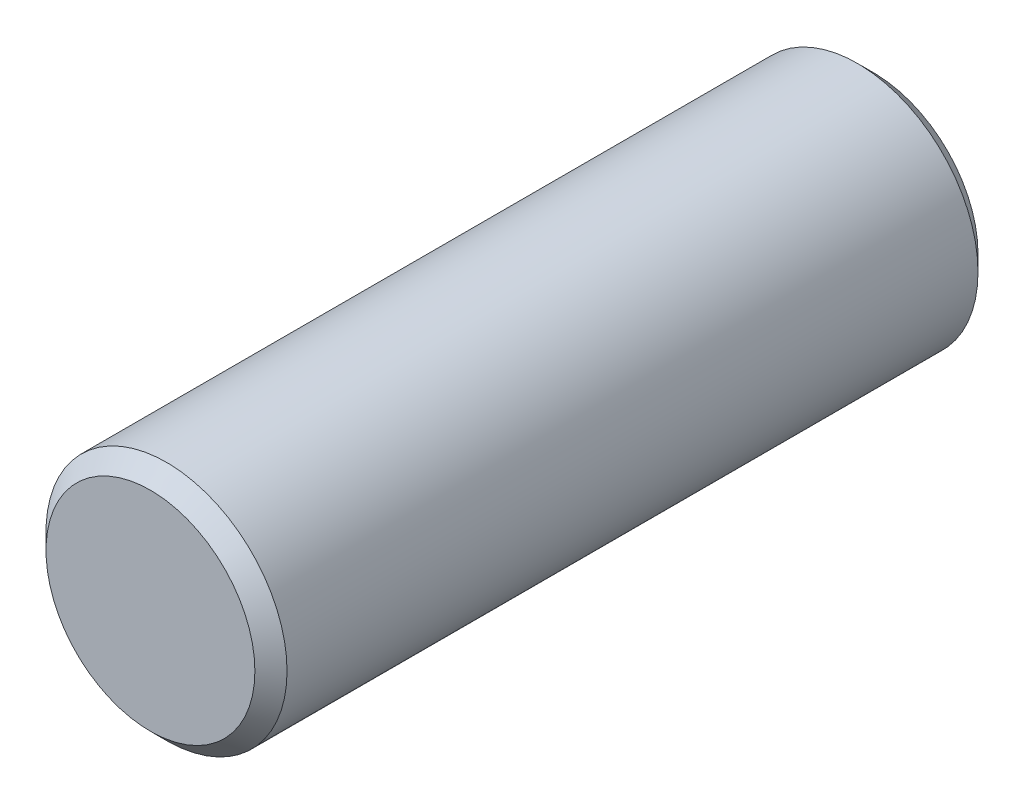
from build123d import *

# Parameters (mm, degrees)
ESQUISSE1_R      = 1.5
EXTRUSION1_DEPTH = 9
CHANFREIN1_SIZE  = 0.2


with BuildPart() as part:
    # Esquisse1 → Extrusion1 (new body)
    with BuildSketch(Plane.XY):
        Circle(ESQUISSE1_R)
    extrude(amount=EXTRUSION1_DEPTH)

    # Chanfrein1
    chanfrein1_edges = [part.edges().sort_by_distance(p)[0] for p in [
        (-1.5, 0, 0),
        (-1.5, 0, 9),
    ]]
    chamfer(chanfrein1_edges, length=CHANFREIN1_SIZE)


solid = part.part
